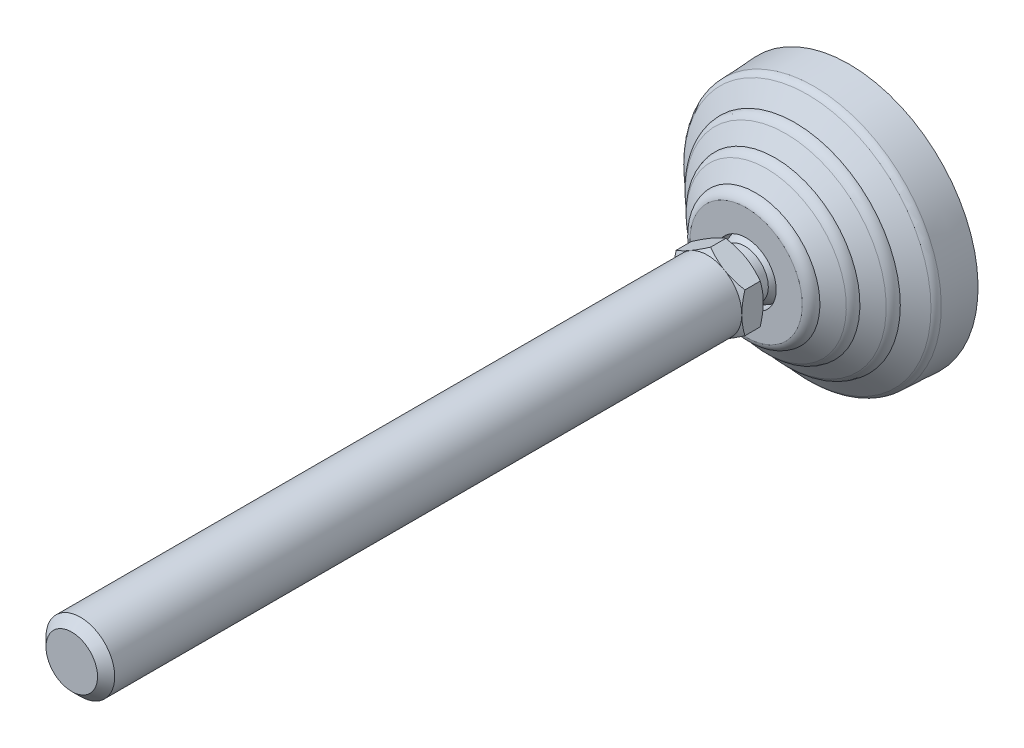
ISO-10303-21;
HEADER;
FILE_DESCRIPTION(('STEP AP214'),'2;1');
FILE_NAME('part.step','',(''),(''),'','','');
FILE_SCHEMA(('AUTOMOTIVE_DESIGN { 1 0 10303 214 1 1 1 1 }'));
ENDSEC;
DATA;
#1=APPLICATION_CONTEXT('core data for automotive mechanical design processes');
#2=APPLICATION_PROTOCOL_DEFINITION('international standard','automotive_design',2000,#1);
#3=PRODUCT_CONTEXT('',#1,'mechanical');
#4=PRODUCT('Part','Part','',(#3));
#5=PRODUCT_RELATED_PRODUCT_CATEGORY('part','',(#4));
#6=PRODUCT_DEFINITION_FORMATION('','',#4);
#7=PRODUCT_DEFINITION_CONTEXT('part definition',#1,'design');
#8=PRODUCT_DEFINITION('design','',#6,#7);
#9=PRODUCT_DEFINITION_SHAPE('','',#8);
#10=(LENGTH_UNIT() NAMED_UNIT(*) SI_UNIT(.MILLI.,.METRE.));
#11=(NAMED_UNIT(*) PLANE_ANGLE_UNIT() SI_UNIT($,.RADIAN.));
#12=(NAMED_UNIT(*) SI_UNIT($,.STERADIAN.) SOLID_ANGLE_UNIT());
#13=UNCERTAINTY_MEASURE_WITH_UNIT(LENGTH_MEASURE(1.E-05),#10,'distance_accuracy_value','');
#14=(GEOMETRIC_REPRESENTATION_CONTEXT(3) GLOBAL_UNCERTAINTY_ASSIGNED_CONTEXT((#13)) GLOBAL_UNIT_ASSIGNED_CONTEXT((#10,
#11,#12)) REPRESENTATION_CONTEXT('',''));
#15=CARTESIAN_POINT('',(0.,0.,0.));
#16=DIRECTION('',(0.,0.,1.));
#17=DIRECTION('',(1.,0.,0.));
#18=AXIS2_PLACEMENT_3D('',#15,#16,#17);
#19=CARTESIAN_POINT('',(0.,0.,85.773));
#20=DIRECTION('',(0.,0.,-1.));
#21=DIRECTION('',(0.,1.,0.));
#22=AXIS2_PLACEMENT_3D('',#19,#20,#21);
#23=CYLINDRICAL_SURFACE('',#22,8.);
#24=CARTESIAN_POINT('',(0.,0.,179.));
#25=DIRECTION('',(0.,0.,1.));
#26=DIRECTION('',(0.,-1.,0.));
#27=AXIS2_PLACEMENT_3D('',#24,#25,#26);
#28=CIRCLE('',#27,8.);
#29=CARTESIAN_POINT('',(0.,-8.,179.));
#30=VERTEX_POINT('',#29);
#31=EDGE_CURVE('E9',#30,#30,#28,.F.);
#32=ORIENTED_EDGE('',*,*,#31,.T.);
#33=EDGE_LOOP('',(#32));
#34=FACE_BOUND('',#33,.T.);
#35=CARTESIAN_POINT('',(0.,0.,33.));
#36=DIRECTION('',(0.,0.,-1.));
#37=DIRECTION('',(0.,1.,0.));
#38=AXIS2_PLACEMENT_3D('',#35,#36,#37);
#39=CIRCLE('',#38,8.);
#40=CARTESIAN_POINT('',(0.,8.,33.));
#41=VERTEX_POINT('',#40);
#42=EDGE_CURVE('E124',#41,#41,#39,.F.);
#43=ORIENTED_EDGE('',*,*,#42,.T.);
#44=EDGE_LOOP('',(#43));
#45=FACE_BOUND('',#44,.T.);
#46=ADVANCED_FACE('F14',(#34,#45),#23,.T.);
#47=CARTESIAN_POINT('',(7.995,0.,33.));
#48=DIRECTION('',(0.,0.,-1.));
#49=DIRECTION('',(0.,1.,0.));
#50=AXIS2_PLACEMENT_3D('',#47,#48,#49);
#51=PLANE('',#50);
#52=CARTESIAN_POINT('',(0.,0.,33.));
#53=DIRECTION('',(0.,0.,-1.));
#54=DIRECTION('',(0.,1.,0.));
#55=AXIS2_PLACEMENT_3D('',#52,#53,#54);
#56=CIRCLE('',#55,7.99);
#57=CARTESIAN_POINT('',(0.,7.99,33.));
#58=VERTEX_POINT('',#57);
#59=EDGE_CURVE('E132',#58,#58,#56,.F.);
#60=ORIENTED_EDGE('',*,*,#59,.T.);
#61=EDGE_LOOP('',(#60));
#62=FACE_BOUND('',#61,.T.);
#63=ORIENTED_EDGE('',*,*,#42,.F.);
#64=EDGE_LOOP('',(#63));
#65=FACE_BOUND('',#64,.T.);
#66=ADVANCED_FACE('F157',(#62,#65),#51,.T.);
#67=CARTESIAN_POINT('',(0.,0.,32.2753734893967));
#68=DIRECTION('',(0.,0.,-1.));
#69=DIRECTION('',(0.,1.,0.));
#70=AXIS2_PLACEMENT_3D('',#67,#68,#69);
#71=CONICAL_SURFACE('',#70,9.2450899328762,1.0471975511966);
#72=ORIENTED_EDGE('',*,*,#59,.F.);
#73=EDGE_LOOP('',(#72));
#74=FACE_BOUND('',#73,.T.);
#75=CARTESIAN_POINT('',(-4.19327851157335E-08,-9.23760428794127,32.2796952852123));
#76=CARTESIAN_POINT('',(0.175847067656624,-9.13607893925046,32.3382996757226));
#77=CARTESIAN_POINT('',(0.352349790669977,-9.03417505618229,32.3942441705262));
#78=CARTESIAN_POINT('',(0.706788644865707,-8.82953969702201,32.5000807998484));
#79=CARTESIAN_POINT('',(0.884725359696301,-8.72680788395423,32.5499703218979));
#80=CARTESIAN_POINT('',(1.42138431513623,-8.41696768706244,32.6895770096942));
#81=CARTESIAN_POINT('',(1.78222493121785,-8.20863626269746,32.7689823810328));
#82=CARTESIAN_POINT('',(2.32221590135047,-7.896872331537,32.862092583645));
#83=CARTESIAN_POINT('',(2.49975318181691,-7.79437113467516,32.8886165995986));
#84=CARTESIAN_POINT('',(2.85563052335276,-7.58890525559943,32.9330919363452));
#85=CARTESIAN_POINT('',(3.03397051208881,-7.48594061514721,32.9510440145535));
#86=CARTESIAN_POINT('',(3.3909574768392,-7.27983409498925,32.9779205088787));
#87=CARTESIAN_POINT('',(3.56960387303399,-7.17669255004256,32.9868551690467));
#88=CARTESIAN_POINT('',(3.92706158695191,-6.97031424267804,32.9955052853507));
#89=CARTESIAN_POINT('',(4.10587289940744,-6.86707748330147,32.995221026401));
#90=CARTESIAN_POINT('',(4.44015430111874,-6.67408002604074,32.9860752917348));
#91=CARTESIAN_POINT('',(4.59564800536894,-6.58430569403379,32.9783294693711));
#92=CARTESIAN_POINT('',(4.90627121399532,-6.4049673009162,32.956016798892));
#93=CARTESIAN_POINT('',(5.06140069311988,-6.31540325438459,32.9414494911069));
#94=CARTESIAN_POINT('',(5.52618852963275,-6.04705787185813,32.8878596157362));
#95=CARTESIAN_POINT('',(5.83502420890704,-5.86875150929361,32.8389557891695));
#96=CARTESIAN_POINT('',(6.45597113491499,-5.51024763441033,32.7166979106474));
#97=CARTESIAN_POINT('',(6.76800315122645,-5.33009586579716,32.6428257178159));
#98=CARTESIAN_POINT('',(7.38741452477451,-4.97247854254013,32.4751673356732));
#99=CARTESIAN_POINT('',(7.69480181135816,-4.79500840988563,32.3814205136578));
#100=CARTESIAN_POINT('',(7.9999999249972,-4.6188021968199,32.2796953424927));
#101=B_SPLINE_CURVE_WITH_KNOTS('',3,(#75,#76,#77,#78,#79,#80,#81,#82,#83,#84,#85,#86,#87,#88,
#89,#90,#91,#92,#93,#94,#95,#96,#97,#98,#99,#100),.UNSPECIFIED.,.F.,.F.,(4,2,2,2,2,2,2,2,2,2,2,
2,4),(0.,0.633965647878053,1.26820386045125,2.53931509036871,3.15930425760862,3.77923863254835,
4.39846794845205,5.01767812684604,5.55669080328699,6.09573980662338,7.17460542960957,
8.2773951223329,9.37802050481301),.UNSPECIFIED.);
#102=CARTESIAN_POINT('',(-1.44240227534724E-08,-9.23760431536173,32.2796953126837));
#103=VERTEX_POINT('',#102);
#104=CARTESIAN_POINT('',(8.,-4.61880217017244,32.2796953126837));
#105=VERTEX_POINT('',#104);
#106=EDGE_CURVE('E143',#103,#105,#101,.T.);
#107=ORIENTED_EDGE('',*,*,#106,.T.);
#108=CARTESIAN_POINT('',(7.9999999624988,-4.6188021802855,32.2796952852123));
#109=CARTESIAN_POINT('',(7.99999998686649,-4.23969380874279,32.3891659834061));
#110=CARTESIAN_POINT('',(7.999999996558,-3.85751175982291,32.4893813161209));
#111=CARTESIAN_POINT('',(8.00000000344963,-3.08693961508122,32.6664987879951));
#112=CARTESIAN_POINT('',(8.00000000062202,-2.69853763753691,32.7433487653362));
#113=CARTESIAN_POINT('',(7.99999999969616,-2.11699996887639,32.8364192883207));
#114=CARTESIAN_POINT('',(7.99999999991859,-1.92560834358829,32.8635449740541));
#115=CARTESIAN_POINT('',(8.0000000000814,-1.54193621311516,32.9104602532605));
#116=CARTESIAN_POINT('',(8.0000000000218,-1.34965578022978,32.9302504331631));
#117=CARTESIAN_POINT('',(7.99999999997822,-0.96464588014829,32.962068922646));
#118=CARTESIAN_POINT('',(7.99999999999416,-0.771917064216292,32.9741050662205));
#119=CARTESIAN_POINT('',(8.00000000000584,-0.386125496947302,32.9901838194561));
#120=CARTESIAN_POINT('',(8.00000000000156,-0.193062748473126,32.9942264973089));
#121=CARTESIAN_POINT('',(7.99999999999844,0.193062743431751,32.9942264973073));
#122=CARTESIAN_POINT('',(7.99999999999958,0.386125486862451,32.990183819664));
#123=CARTESIAN_POINT('',(8.00000000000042,0.771917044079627,32.9741050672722));
#124=CARTESIAN_POINT('',(8.00000000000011,0.96464585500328,32.962068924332));
#125=CARTESIAN_POINT('',(7.99999999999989,1.34965574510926,32.930250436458));
#126=CARTESIAN_POINT('',(7.99999999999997,1.54193617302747,32.9104602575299));
#127=CARTESIAN_POINT('',(8.00000000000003,1.92560829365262,32.8635449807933));
#128=CARTESIAN_POINT('',(8.00000000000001,2.11699991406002,32.8364192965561));
#129=CARTESIAN_POINT('',(7.99999999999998,2.69853756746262,32.7433487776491));
#130=CARTESIAN_POINT('',(7.99999999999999,3.0869395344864,32.6664988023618));
#131=CARTESIAN_POINT('',(8.00000000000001,3.85751166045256,32.4893813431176));
#132=CARTESIAN_POINT('',(8.00000000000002,4.23969370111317,32.3891660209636));
#133=CARTESIAN_POINT('',(8.,4.61880206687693,32.2796953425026));
#134=B_SPLINE_CURVE_WITH_KNOTS('',3,(#108,#109,#110,#111,#112,#113,#114,#115,#116,#117,#118,
#119,#120,#121,#122,#123,#124,#125,#126,#127,#128,#129,#130,#131,#132,#133),.UNSPECIFIED.,.F.,
.F.,(4,2,2,2,2,2,2,2,2,2,2,2,4),(0.,1.1842935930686,2.37121196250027,2.95099639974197,
3.53073447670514,4.10988591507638,4.68903241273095,5.26817889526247,5.84733031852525,
6.42706838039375,7.00685280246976,8.19377114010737,9.37806470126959),.UNSPECIFIED.);
#135=CARTESIAN_POINT('',(8.00000001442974,4.618802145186,32.2796953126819));
#136=VERTEX_POINT('',#135);
#137=EDGE_CURVE('E135',#105,#136,#134,.T.);
#138=ORIENTED_EDGE('',*,*,#137,.T.);
#139=CARTESIAN_POINT('',(8.00000000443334,4.61880210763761,32.2796952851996));
#140=CARTESIAN_POINT('',(7.82415291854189,4.72032749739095,32.3382996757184));
#141=CARTESIAN_POINT('',(7.64765020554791,4.8222313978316,32.3942441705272));
#142=CARTESIAN_POINT('',(7.29321135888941,5.02686677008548,32.500080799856));
#143=CARTESIAN_POINT('',(7.11527464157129,5.12959857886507,32.549970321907));
#144=CARTESIAN_POINT('',(6.57861568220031,5.43943876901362,32.689577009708));
#145=CARTESIAN_POINT('',(6.21777506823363,5.6477701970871,32.7689823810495));
#146=CARTESIAN_POINT('',(5.67778409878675,5.95953412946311,32.8620925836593));
#147=CARTESIAN_POINT('',(5.50024681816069,6.06203532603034,32.8886165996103));
#148=CARTESIAN_POINT('',(5.14436947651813,6.2675012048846,32.9330919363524));
#149=CARTESIAN_POINT('',(4.96602948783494,6.37046584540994,32.9510440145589));
#150=CARTESIAN_POINT('',(4.60904252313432,6.57657236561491,32.977920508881));
#151=CARTESIAN_POINT('',(4.43039612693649,6.6797139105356,32.986855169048));
#152=CARTESIAN_POINT('',(4.0729384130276,6.88609221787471,32.9955052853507));
#153=CARTESIAN_POINT('',(3.89412710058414,6.98932897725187,32.9952210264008));
#154=CARTESIAN_POINT('',(3.55984569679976,7.18232643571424,32.9860752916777));
#155=CARTESIAN_POINT('',(3.40435199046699,7.27210076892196,32.9783294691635));
#156=CARTESIAN_POINT('',(3.09372877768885,7.45143916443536,32.9560167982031));
#157=CARTESIAN_POINT('',(2.93859929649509,7.54100321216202,32.9414494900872));
#158=CARTESIAN_POINT('',(2.47381145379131,7.80934859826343,32.8878596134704));
#159=CARTESIAN_POINT('',(2.16497577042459,7.98765496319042,32.8389557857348));
#160=CARTESIAN_POINT('',(1.54402883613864,8.34615884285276,32.7166979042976));
#161=CARTESIAN_POINT('',(1.23199681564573,8.52631061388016,32.6428257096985));
#162=CARTESIAN_POINT('',(0.612585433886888,8.8839279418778,32.4751673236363));
#163=CARTESIAN_POINT('',(0.305198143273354,9.06139807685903,32.3814204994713));
#164=CARTESIAN_POINT('',(2.56600579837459E-08,9.23760429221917,32.2796953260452));
#165=B_SPLINE_CURVE_WITH_KNOTS('',3,(#139,#140,#141,#142,#143,#144,#145,#146,#147,#148,#149,
#150,#151,#152,#153,#154,#155,#156,#157,#158,#159,#160,#161,#162,#163,#164),.UNSPECIFIED.,.F.,
.F.,(4,2,2,2,2,2,2,2,2,2,2,2,4),(0.,0.633965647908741,1.26820386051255,2.53931509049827,
3.15930425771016,3.77923863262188,4.39846794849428,5.01767812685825,5.55669081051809,
6.09573982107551,7.1746054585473,8.27739516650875,9.37802056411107),.UNSPECIFIED.);
#166=CARTESIAN_POINT('',(-1.15386855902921E-08,9.23760430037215,32.279695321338));
#167=VERTEX_POINT('',#166);
#168=EDGE_CURVE('E180',#136,#167,#165,.T.);
#169=ORIENTED_EDGE('',*,*,#168,.T.);
#170=CARTESIAN_POINT('',(-1.65350876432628E-08,9.23760427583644,32.2796953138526));
#171=CARTESIAN_POINT('',(-0.175847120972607,9.13607891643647,32.3382996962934));
#172=CARTESIAN_POINT('',(-0.352349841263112,9.03417502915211,32.3942441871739));
#173=CARTESIAN_POINT('',(-0.706788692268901,8.82953966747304,32.5000808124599));
#174=CARTESIAN_POINT('',(-0.884725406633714,8.72680785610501,32.5499703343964));
#175=CARTESIAN_POINT('',(-1.42138436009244,8.41696766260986,32.6895770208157));
#176=CARTESIAN_POINT('',(-1.78222497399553,8.20863623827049,32.7689823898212));
#177=CARTESIAN_POINT('',(-2.32221594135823,7.89687230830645,32.8620925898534));
#178=CARTESIAN_POINT('',(-2.4997532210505,7.79437111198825,32.8886166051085));
#179=CARTESIAN_POINT('',(-2.85563056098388,7.58890523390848,32.9330919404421));
#180=CARTESIAN_POINT('',(-3.03397054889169,7.48594059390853,32.9510440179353));
#181=CARTESIAN_POINT('',(-3.39095751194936,7.27983407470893,32.9779205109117));
#182=CARTESIAN_POINT('',(-3.56960390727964,7.1766925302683,32.9868551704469));
#183=CARTESIAN_POINT('',(-3.92706161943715,6.97031422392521,32.9955052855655));
#184=CARTESIAN_POINT('',(-4.10587293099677,6.867077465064,32.9952210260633));
#185=CARTESIAN_POINT('',(-4.44015433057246,6.67408000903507,32.9860752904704));
#186=CARTESIAN_POINT('',(-4.59564803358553,6.58430567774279,32.9783294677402));
#187=CARTESIAN_POINT('',(-4.90627123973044,6.40496728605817,32.9560167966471));
#188=CARTESIAN_POINT('',(-5.06140071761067,6.31540324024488,32.9414494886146));
#189=CARTESIAN_POINT('',(-5.52618855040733,6.04705785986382,32.8878596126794));
#190=CARTESIAN_POINT('',(-5.83502422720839,5.8687514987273,32.8389557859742));
#191=CARTESIAN_POINT('',(-6.45597114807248,5.51024762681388,32.7166979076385));
#192=CARTESIAN_POINT('',(-6.76800316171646,5.33009585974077,32.6428257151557));
#193=CARTESIAN_POINT('',(-7.38741452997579,4.97247853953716,32.4751673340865));
#194=CARTESIAN_POINT('',(-7.69480181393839,4.7950084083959,32.381420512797));
#195=CARTESIAN_POINT('',(-7.9999999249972,4.6188021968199,32.2796953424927));
#196=B_SPLINE_CURVE_WITH_KNOTS('',3,(#170,#171,#172,#173,#174,#175,#176,#177,#178,#179,#180,
#181,#182,#183,#184,#185,#186,#187,#188,#189,#190,#191,#192,#193,#194,#195),.UNSPECIFIED.,.F.,
.F.,(4,2,2,2,2,2,2,2,2,2,2,2,4),(0.,0.633965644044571,1.26820385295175,2.5393150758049,
3.15930423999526,3.77923861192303,4.39846792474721,5.01767810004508,5.55669077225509,
6.09573977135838,7.17460538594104,8.27739506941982,9.37802044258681),.UNSPECIFIED.);
#197=CARTESIAN_POINT('',(-8.,4.61880217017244,32.2796953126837));
#198=VERTEX_POINT('',#197);
#199=EDGE_CURVE('E172',#167,#198,#196,.T.);
#200=ORIENTED_EDGE('',*,*,#199,.T.);
#201=CARTESIAN_POINT('',(-7.9999999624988,4.6188021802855,32.2796952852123));
#202=CARTESIAN_POINT('',(-7.99999998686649,4.23969380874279,32.3891659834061));
#203=CARTESIAN_POINT('',(-7.999999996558,3.85751175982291,32.4893813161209));
#204=CARTESIAN_POINT('',(-8.00000000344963,3.08693961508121,32.6664987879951));
#205=CARTESIAN_POINT('',(-8.00000000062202,2.69853763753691,32.7433487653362));
#206=CARTESIAN_POINT('',(-7.99999999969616,2.11699996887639,32.8364192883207));
#207=CARTESIAN_POINT('',(-7.99999999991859,1.92560834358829,32.8635449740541));
#208=CARTESIAN_POINT('',(-8.0000000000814,1.54193621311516,32.9104602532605));
#209=CARTESIAN_POINT('',(-8.0000000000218,1.34965578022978,32.9302504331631));
#210=CARTESIAN_POINT('',(-7.99999999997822,0.964645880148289,32.962068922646));
#211=CARTESIAN_POINT('',(-7.99999999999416,0.77191706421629,32.9741050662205));
#212=CARTESIAN_POINT('',(-8.00000000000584,0.386125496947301,32.9901838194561));
#213=CARTESIAN_POINT('',(-8.00000000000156,0.193062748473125,32.9942264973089));
#214=CARTESIAN_POINT('',(-7.99999999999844,-0.193062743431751,32.9942264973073));
#215=CARTESIAN_POINT('',(-7.99999999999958,-0.386125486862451,32.990183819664));
#216=CARTESIAN_POINT('',(-8.00000000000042,-0.771917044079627,32.9741050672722));
#217=CARTESIAN_POINT('',(-8.00000000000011,-0.96464585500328,32.962068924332));
#218=CARTESIAN_POINT('',(-7.99999999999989,-1.34965574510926,32.930250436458));
#219=CARTESIAN_POINT('',(-7.99999999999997,-1.54193617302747,32.9104602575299));
#220=CARTESIAN_POINT('',(-8.00000000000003,-1.92560829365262,32.8635449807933));
#221=CARTESIAN_POINT('',(-8.00000000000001,-2.11699991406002,32.8364192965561));
#222=CARTESIAN_POINT('',(-7.99999999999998,-2.69853756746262,32.7433487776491));
#223=CARTESIAN_POINT('',(-7.99999999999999,-3.0869395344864,32.6664988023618));
#224=CARTESIAN_POINT('',(-8.00000000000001,-3.85751166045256,32.4893813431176));
#225=CARTESIAN_POINT('',(-8.00000000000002,-4.23969370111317,32.3891660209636));
#226=CARTESIAN_POINT('',(-8.,-4.61880206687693,32.2796953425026));
#227=B_SPLINE_CURVE_WITH_KNOTS('',3,(#201,#202,#203,#204,#205,#206,#207,#208,#209,#210,#211,
#212,#213,#214,#215,#216,#217,#218,#219,#220,#221,#222,#223,#224,#225,#226),.UNSPECIFIED.,.F.,
.F.,(4,2,2,2,2,2,2,2,2,2,2,2,4),(0.,1.18429359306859,2.37121196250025,2.95099639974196,
3.53073447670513,4.10988591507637,4.68903241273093,5.26817889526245,5.84733031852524,
6.42706838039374,7.00685280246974,8.19377114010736,9.37806470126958),.UNSPECIFIED.);
#228=CARTESIAN_POINT('',(-8.00000001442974,-4.61880214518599,32.2796953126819));
#229=VERTEX_POINT('',#228);
#230=EDGE_CURVE('E342',#198,#229,#227,.T.);
#231=ORIENTED_EDGE('',*,*,#230,.T.);
#232=CARTESIAN_POINT('',(-8.00000000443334,-4.61880210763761,32.2796952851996));
#233=CARTESIAN_POINT('',(-7.82415291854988,-4.72032749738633,32.3382996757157));
#234=CARTESIAN_POINT('',(-7.64765020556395,-4.82223139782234,32.3942441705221));
#235=CARTESIAN_POINT('',(-7.29321135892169,-5.02686677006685,32.5000807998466));
#236=CARTESIAN_POINT('',(-7.11527464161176,-5.1295985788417,32.5499703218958));
#237=CARTESIAN_POINT('',(-6.57861568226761,-5.43943876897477,32.6895770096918));
#238=CARTESIAN_POINT('',(-6.21777506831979,-5.64777019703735,32.7689823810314));
#239=CARTESIAN_POINT('',(-5.67778409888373,-5.95953412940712,32.8620925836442));
#240=CARTESIAN_POINT('',(-5.50024681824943,-6.06203532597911,32.8886165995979));
#241=CARTESIAN_POINT('',(-5.14436947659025,-6.26750120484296,32.9330919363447));
#242=CARTESIAN_POINT('',(-4.96602948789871,-6.37046584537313,32.9510440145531));
#243=CARTESIAN_POINT('',(-4.60904252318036,-6.57657236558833,32.9779205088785));
#244=CARTESIAN_POINT('',(-4.43039612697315,-6.67971391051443,32.9868551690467));
#245=CARTESIAN_POINT('',(-4.0729384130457,-6.88609221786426,32.9955052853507));
#246=CARTESIAN_POINT('',(-3.89412710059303,-6.98932897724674,32.995221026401));
#247=CARTESIAN_POINT('',(-3.55984569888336,-7.18232643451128,32.9860752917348));
#248=CARTESIAN_POINT('',(-3.40435199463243,-7.27210076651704,32.9783294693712));
#249=CARTESIAN_POINT('',(-3.09372878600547,-7.45143915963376,32.9560167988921));
#250=CARTESIAN_POINT('',(-2.93859930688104,-7.54100320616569,32.941449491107));
#251=CARTESIAN_POINT('',(-2.47381147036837,-7.80934858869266,32.8878596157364));
#252=CARTESIAN_POINT('',(-2.16497579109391,-7.98765495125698,32.8389557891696));
#253=CARTESIAN_POINT('',(-1.54402886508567,-8.34615882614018,32.7166979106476));
#254=CARTESIAN_POINT('',(-1.2319968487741,-8.52631059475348,32.642825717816));
#255=CARTESIAN_POINT('',(-0.612585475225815,-8.88392791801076,32.4751673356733));
#256=CARTESIAN_POINT('',(-0.305198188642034,-9.06139805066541,32.3814205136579));
#257=CARTESIAN_POINT('',(-7.50027841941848E-08,-9.23760426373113,32.2796953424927));
#258=B_SPLINE_CURVE_WITH_KNOTS('',3,(#232,#233,#234,#235,#236,#237,#238,#239,#240,#241,#242,
#243,#244,#245,#246,#247,#248,#249,#250,#251,#252,#253,#254,#255,#256,#257),.UNSPECIFIED.,.F.,
.F.,(4,2,2,2,2,2,2,2,2,2,2,2,4),(0.,0.633965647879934,1.26820386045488,2.53931509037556,
3.15930425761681,3.77923863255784,4.39846794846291,5.01767812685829,5.55669080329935,
6.09573980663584,7.17460542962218,8.27739512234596,9.37802050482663),.UNSPECIFIED.);
#259=EDGE_CURVE('E162',#229,#103,#258,.T.);
#260=ORIENTED_EDGE('',*,*,#259,.T.);
#261=EDGE_LOOP('',(#107,#138,#169,#200,#231,#260));
#262=FACE_BOUND('',#261,.T.);
#263=ADVANCED_FACE('F152',(#74,#262),#71,.T.);
#264=CARTESIAN_POINT('',(0.,-9.23760430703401,33.1));
#265=DIRECTION('',(0.5,0.866025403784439,0.));
#266=DIRECTION('',(-0.866025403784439,0.5,0.));
#267=AXIS2_PLACEMENT_3D('',#264,#265,#266);
#268=PLANE('',#267);
#269=DIRECTION('',(0.,0.,1.));
#270=VECTOR('',#269,1.);
#271=CARTESIAN_POINT('',(0.,-9.23760430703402,33.1));
#272=LINE('',#271,#270);
#273=CARTESIAN_POINT('',(0.,-9.23760430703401,28.7203046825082));
#274=VERTEX_POINT('',#273);
#275=EDGE_CURVE('E368',#274,#103,#272,.T.);
#276=ORIENTED_EDGE('',*,*,#275,.T.);
#277=ORIENTED_EDGE('',*,*,#259,.F.);
#278=DIRECTION('',(0.,0.,1.));
#279=VECTOR('',#278,1.);
#280=CARTESIAN_POINT('',(-8.,-4.61880215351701,33.1));
#281=LINE('',#280,#279);
#282=CARTESIAN_POINT('',(-8.,-4.61880215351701,28.7203046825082));
#283=VERTEX_POINT('',#282);
#284=EDGE_CURVE('E360',#283,#229,#281,.T.);
#285=ORIENTED_EDGE('',*,*,#284,.F.);
#286=CARTESIAN_POINT('',(0.,-9.23760430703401,28.7203046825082));
#287=CARTESIAN_POINT('',(-0.175847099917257,-9.13607893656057,28.6617003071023));
#288=CARTESIAN_POINT('',(-0.35234981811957,-9.03417504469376,28.6057558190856));
#289=CARTESIAN_POINT('',(-0.706788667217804,-8.82953967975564,28.4999191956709));
#290=CARTESIAN_POINT('',(-0.884725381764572,-8.72680786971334,28.4500296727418));
#291=CARTESIAN_POINT('',(-1.42138433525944,-8.41696767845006,28.3104229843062));
#292=CARTESIAN_POINT('',(-1.78222494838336,-8.20863625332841,28.2310176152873));
#293=CARTESIAN_POINT('',(-2.32221591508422,-7.89687232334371,28.1379074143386));
#294=CARTESIAN_POINT('',(-2.49975319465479,-7.79437112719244,28.1113833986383));
#295=CARTESIAN_POINT('',(-2.8556305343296,-7.5889052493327,28.0669080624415));
#296=CARTESIAN_POINT('',(-3.03397052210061,-7.48594060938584,28.0489559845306));
#297=CARTESIAN_POINT('',(-3.3909574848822,-7.2798340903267,28.0220794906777));
#298=CARTESIAN_POINT('',(-3.56960388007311,-7.17669254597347,28.0131448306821));
#299=CARTESIAN_POINT('',(-3.9270615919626,-6.97031423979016,28.0044947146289));
#300=CARTESIAN_POINT('',(-4.10587290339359,-6.86707748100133,28.0047789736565));
#301=CARTESIAN_POINT('',(-4.44015430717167,-6.67408002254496,28.0139247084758));
#302=CARTESIAN_POINT('',(-4.59564801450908,-6.58430568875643,28.0216705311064));
#303=CARTESIAN_POINT('',(-4.90627122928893,-6.40496729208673,28.0439832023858));
#304=CARTESIAN_POINT('',(-5.06140071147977,-6.3154032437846,28.0585505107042));
#305=CARTESIAN_POINT('',(-5.52618855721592,-6.04705785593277,28.1121403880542));
#306=CARTESIAN_POINT('',(-5.83502424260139,-5.86875148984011,28.161044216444));
#307=CARTESIAN_POINT('',(-6.45597118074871,-5.51024760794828,28.2833020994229));
#308=CARTESIAN_POINT('',(-6.76800320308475,-5.33009583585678,28.3571742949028));
#309=CARTESIAN_POINT('',(-7.38741458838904,-4.97247850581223,28.5248326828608));
#310=CARTESIAN_POINT('',(-7.69480188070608,-4.79500836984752,28.6185795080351));
#311=CARTESIAN_POINT('',(-8.,-4.61880215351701,28.7203046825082));
#312=B_SPLINE_CURVE_WITH_KNOTS('',3,(#286,#287,#288,#289,#290,#291,#292,#293,#294,#295,#296,
#297,#298,#299,#300,#301,#302,#303,#304,#305,#306,#307,#308,#309,#310,#311),.UNSPECIFIED.,.F.,
.F.,(4,2,2,2,2,2,2,2,2,2,2,2,4),(0.,0.633965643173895,1.26820385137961,2.53931507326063,
3.15930423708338,3.77923860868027,4.3984679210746,5.01767809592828,5.55669078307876,
6.0957397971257,7.17460544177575,8.27739515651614,9.37802056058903),.UNSPECIFIED.);
#313=EDGE_CURVE('E362',#274,#283,#312,.T.);
#314=ORIENTED_EDGE('',*,*,#313,.F.);
#315=EDGE_LOOP('',(#276,#277,#285,#314));
#316=FACE_BOUND('',#315,.T.);
#317=ADVANCED_FACE('F156',(#316),#268,.F.);
#318=CARTESIAN_POINT('',(8.,-4.61880215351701,33.1));
#319=DIRECTION('',(-0.5,0.866025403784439,0.));
#320=DIRECTION('',(-0.866025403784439,-0.5,0.));
#321=AXIS2_PLACEMENT_3D('',#318,#319,#320);
#322=PLANE('',#321);
#323=DIRECTION('',(0.,0.,1.));
#324=VECTOR('',#323,1.);
#325=CARTESIAN_POINT('',(8.,-4.61880215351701,33.1));
#326=LINE('',#325,#324);
#327=CARTESIAN_POINT('',(8.,-4.61880215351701,28.7203046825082));
#328=VERTEX_POINT('',#327);
#329=EDGE_CURVE('E31',#328,#105,#326,.T.);
#330=ORIENTED_EDGE('',*,*,#329,.T.);
#331=ORIENTED_EDGE('',*,*,#106,.F.);
#332=ORIENTED_EDGE('',*,*,#275,.F.);
#333=CARTESIAN_POINT('',(8.,-4.61880215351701,28.7203046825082));
#334=CARTESIAN_POINT('',(7.82415290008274,-4.72032752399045,28.6617003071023));
#335=CARTESIAN_POINT('',(7.64765018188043,-4.82223141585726,28.6057558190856));
#336=CARTESIAN_POINT('',(7.2932113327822,-5.02686678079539,28.4999191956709));
#337=CARTESIAN_POINT('',(7.11527461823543,-5.12959859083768,28.4500296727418));
#338=CARTESIAN_POINT('',(6.57861566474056,-5.43943878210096,28.3104229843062));
#339=CARTESIAN_POINT('',(6.21777505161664,-5.64777020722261,28.2310176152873));
#340=CARTESIAN_POINT('',(5.67778408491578,-5.95953413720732,28.1379074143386));
#341=CARTESIAN_POINT('',(5.50024680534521,-6.06203533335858,28.1113833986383));
#342=CARTESIAN_POINT('',(5.14436946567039,-6.26750121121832,28.0669080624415));
#343=CARTESIAN_POINT('',(4.96602947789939,-6.37046585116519,28.0489559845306));
#344=CARTESIAN_POINT('',(4.60904251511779,-6.57657237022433,28.0220794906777));
#345=CARTESIAN_POINT('',(4.43039611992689,-6.67971391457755,28.0131448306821));
#346=CARTESIAN_POINT('',(4.0729384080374,-6.88609222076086,28.0044947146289));
#347=CARTESIAN_POINT('',(3.89412709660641,-6.98932897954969,28.0047789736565));
#348=CARTESIAN_POINT('',(3.55984569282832,-7.18232643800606,28.0139247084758));
#349=CARTESIAN_POINT('',(3.40435198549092,-7.2721007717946,28.0216705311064));
#350=CARTESIAN_POINT('',(3.09372877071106,-7.45143916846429,28.0439832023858));
#351=CARTESIAN_POINT('',(2.93859928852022,-7.54100321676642,28.0585505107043));
#352=CARTESIAN_POINT('',(2.47381144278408,-7.80934860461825,28.1121403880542));
#353=CARTESIAN_POINT('',(2.16497575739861,-7.98765497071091,28.161044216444));
#354=CARTESIAN_POINT('',(1.54402881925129,-8.34615885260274,28.2833020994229));
#355=CARTESIAN_POINT('',(1.23199679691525,-8.52631062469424,28.3571742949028));
#356=CARTESIAN_POINT('',(0.612585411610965,-8.88392795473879,28.5248326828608));
#357=CARTESIAN_POINT('',(0.305198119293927,-9.0613980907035,28.6185795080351));
#358=CARTESIAN_POINT('',(0.,-9.23760430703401,28.7203046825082));
#359=B_SPLINE_CURVE_WITH_KNOTS('',3,(#333,#334,#335,#336,#337,#338,#339,#340,#341,#342,#343,
#344,#345,#346,#347,#348,#349,#350,#351,#352,#353,#354,#355,#356,#357,#358),.UNSPECIFIED.,.F.,
.F.,(4,2,2,2,2,2,2,2,2,2,2,2,4),(0.,0.633965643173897,1.26820385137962,2.53931507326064,
3.15930423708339,3.77923860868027,4.39846792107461,5.01767809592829,5.55669078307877,
6.09573979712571,7.17460544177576,8.27739515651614,9.37802056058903),.UNSPECIFIED.);
#360=EDGE_CURVE('E369',#328,#274,#359,.T.);
#361=ORIENTED_EDGE('',*,*,#360,.F.);
#362=EDGE_LOOP('',(#330,#331,#332,#361));
#363=FACE_BOUND('',#362,.T.);
#364=ADVANCED_FACE('F375',(#363),#322,.F.);
#365=CARTESIAN_POINT('',(-8.,4.61880215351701,33.1));
#366=DIRECTION('',(0.5,-0.866025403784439,0.));
#367=DIRECTION('',(0.866025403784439,0.5,0.));
#368=AXIS2_PLACEMENT_3D('',#365,#366,#367);
#369=PLANE('',#368);
#370=DIRECTION('',(0.,0.,1.));
#371=VECTOR('',#370,1.);
#372=CARTESIAN_POINT('',(-8.,4.61880215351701,33.1));
#373=LINE('',#372,#371);
#374=CARTESIAN_POINT('',(-8.,4.61880215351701,28.7203046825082));
#375=VERTEX_POINT('',#374);
#376=EDGE_CURVE('E361',#375,#198,#373,.T.);
#377=ORIENTED_EDGE('',*,*,#376,.T.);
#378=ORIENTED_EDGE('',*,*,#199,.F.);
#379=DIRECTION('',(0.,0.,1.));
#380=VECTOR('',#379,1.);
#381=CARTESIAN_POINT('',(0.,9.23760430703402,33.1));
#382=LINE('',#381,#380);
#383=CARTESIAN_POINT('',(0.,9.23760430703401,28.7203046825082));
#384=VERTEX_POINT('',#383);
#385=EDGE_CURVE('E211',#384,#167,#382,.T.);
#386=ORIENTED_EDGE('',*,*,#385,.F.);
#387=CARTESIAN_POINT('',(-8.,4.61880215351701,28.7203046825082));
#388=CARTESIAN_POINT('',(-7.82415290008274,4.72032752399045,28.6617003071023));
#389=CARTESIAN_POINT('',(-7.64765018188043,4.82223141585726,28.6057558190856));
#390=CARTESIAN_POINT('',(-7.2932113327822,5.02686678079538,28.4999191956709));
#391=CARTESIAN_POINT('',(-7.11527461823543,5.12959859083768,28.4500296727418));
#392=CARTESIAN_POINT('',(-6.57861566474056,5.43943878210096,28.3104229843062));
#393=CARTESIAN_POINT('',(-6.21777505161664,5.64777020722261,28.2310176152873));
#394=CARTESIAN_POINT('',(-5.67778408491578,5.95953413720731,28.1379074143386));
#395=CARTESIAN_POINT('',(-5.50024680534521,6.06203533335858,28.1113833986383));
#396=CARTESIAN_POINT('',(-5.1443694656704,6.26750121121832,28.0669080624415));
#397=CARTESIAN_POINT('',(-4.96602947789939,6.37046585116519,28.0489559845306));
#398=CARTESIAN_POINT('',(-4.60904251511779,6.57657237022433,28.0220794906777));
#399=CARTESIAN_POINT('',(-4.43039611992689,6.67971391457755,28.0131448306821));
#400=CARTESIAN_POINT('',(-4.0729384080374,6.88609222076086,28.0044947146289));
#401=CARTESIAN_POINT('',(-3.89412709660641,6.98932897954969,28.0047789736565));
#402=CARTESIAN_POINT('',(-3.55984569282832,7.18232643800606,28.0139247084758));
#403=CARTESIAN_POINT('',(-3.40435198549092,7.2721007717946,28.0216705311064));
#404=CARTESIAN_POINT('',(-3.09372877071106,7.45143916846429,28.0439832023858));
#405=CARTESIAN_POINT('',(-2.93859928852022,7.54100321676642,28.0585505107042));
#406=CARTESIAN_POINT('',(-2.47381144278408,7.80934860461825,28.1121403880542));
#407=CARTESIAN_POINT('',(-2.16497575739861,7.98765497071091,28.161044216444));
#408=CARTESIAN_POINT('',(-1.54402881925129,8.34615885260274,28.2833020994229));
#409=CARTESIAN_POINT('',(-1.23199679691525,8.52631062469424,28.3571742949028));
#410=CARTESIAN_POINT('',(-0.612585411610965,8.88392795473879,28.5248326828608));
#411=CARTESIAN_POINT('',(-0.305198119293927,9.0613980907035,28.6185795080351));
#412=CARTESIAN_POINT('',(0.,9.23760430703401,28.7203046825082));
#413=B_SPLINE_CURVE_WITH_KNOTS('',3,(#387,#388,#389,#390,#391,#392,#393,#394,#395,#396,#397,
#398,#399,#400,#401,#402,#403,#404,#405,#406,#407,#408,#409,#410,#411,#412),.UNSPECIFIED.,.F.,
.F.,(4,2,2,2,2,2,2,2,2,2,2,2,4),(0.,0.633965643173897,1.26820385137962,2.53931507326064,
3.15930423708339,3.77923860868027,4.39846792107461,5.01767809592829,5.55669078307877,
6.09573979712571,7.17460544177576,8.27739515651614,9.37802056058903),.UNSPECIFIED.);
#414=EDGE_CURVE('E213',#375,#384,#413,.T.);
#415=ORIENTED_EDGE('',*,*,#414,.F.);
#416=EDGE_LOOP('',(#377,#378,#386,#415));
#417=FACE_BOUND('',#416,.T.);
#418=ADVANCED_FACE('F199',(#417),#369,.F.);
#419=CARTESIAN_POINT('',(-8.,-4.61880215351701,33.1));
#420=DIRECTION('',(1.,0.,0.));
#421=DIRECTION('',(0.,1.,0.));
#422=AXIS2_PLACEMENT_3D('',#419,#420,#421);
#423=PLANE('',#422);
#424=ORIENTED_EDGE('',*,*,#284,.T.);
#425=ORIENTED_EDGE('',*,*,#230,.F.);
#426=ORIENTED_EDGE('',*,*,#376,.F.);
#427=CARTESIAN_POINT('',(-8.,-4.618802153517,28.7203046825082));
#428=CARTESIAN_POINT('',(-8.,-4.23969378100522,28.6108340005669));
#429=CARTESIAN_POINT('',(-8.,-3.85751173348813,28.5106186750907));
#430=CARTESIAN_POINT('',(-8.,-3.08693959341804,28.333501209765));
#431=CARTESIAN_POINT('',(-8.,-2.69853761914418,28.2566512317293));
#432=CARTESIAN_POINT('',(-8.,-2.11699995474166,28.163580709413));
#433=CARTESIAN_POINT('',(-8.,-1.9256083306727,28.1364550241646));
#434=CARTESIAN_POINT('',(-8.,-1.54193620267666,28.0895397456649));
#435=CARTESIAN_POINT('',(-8.,-1.34965577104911,28.0697495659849));
#436=CARTESIAN_POINT('',(-8.,-0.964645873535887,28.0379310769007));
#437=CARTESIAN_POINT('',(-8.,-0.771917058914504,28.0258949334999));
#438=CARTESIAN_POINT('',(-8.,-0.38612549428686,28.0098161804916));
#439=CARTESIAN_POINT('',(-8.,-0.19306274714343,28.0057735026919));
#440=CARTESIAN_POINT('',(-8.,0.19306274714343,28.0057735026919));
#441=CARTESIAN_POINT('',(-8.,0.38612549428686,28.0098161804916));
#442=CARTESIAN_POINT('',(-8.,0.771917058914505,28.0258949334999));
#443=CARTESIAN_POINT('',(-8.,0.964645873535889,28.0379310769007));
#444=CARTESIAN_POINT('',(-8.,1.34965577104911,28.0697495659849));
#445=CARTESIAN_POINT('',(-8.,1.54193620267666,28.0895397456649));
#446=CARTESIAN_POINT('',(-8.,1.9256083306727,28.1364550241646));
#447=CARTESIAN_POINT('',(-8.,2.11699995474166,28.163580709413));
#448=CARTESIAN_POINT('',(-8.,2.69853761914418,28.2566512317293));
#449=CARTESIAN_POINT('',(-8.,3.08693959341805,28.333501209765));
#450=CARTESIAN_POINT('',(-8.,3.85751173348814,28.5106186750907));
#451=CARTESIAN_POINT('',(-8.,4.23969378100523,28.6108340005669));
#452=CARTESIAN_POINT('',(-8.,4.61880215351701,28.7203046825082));
#453=B_SPLINE_CURVE_WITH_KNOTS('',3,(#427,#428,#429,#430,#431,#432,#433,#434,#435,#436,#437,
#438,#439,#440,#441,#442,#443,#444,#445,#446,#447,#448,#449,#450,#451,#452),.UNSPECIFIED.,.F.,
.F.,(4,2,2,2,2,2,2,2,2,2,2,2,4),(0.,1.18429358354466,2.37121194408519,2.95099637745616,
3.53073445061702,4.10988588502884,4.68903237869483,5.26817887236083,5.84733030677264,
6.42706837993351,7.00685281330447,8.19377117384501,9.37806475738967),.UNSPECIFIED.);
#454=EDGE_CURVE('E354',#283,#375,#453,.T.);
#455=ORIENTED_EDGE('',*,*,#454,.F.);
#456=EDGE_LOOP('',(#424,#425,#426,#455));
#457=FACE_BOUND('',#456,.T.);
#458=ADVANCED_FACE('F348',(#457),#423,.F.);
#459=CARTESIAN_POINT('',(8.,4.61880215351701,33.1));
#460=DIRECTION('',(-1.,0.,0.));
#461=DIRECTION('',(0.,-1.,0.));
#462=AXIS2_PLACEMENT_3D('',#459,#460,#461);
#463=PLANE('',#462);
#464=DIRECTION('',(0.,0.,1.));
#465=VECTOR('',#464,1.);
#466=CARTESIAN_POINT('',(8.,4.61880215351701,33.1));
#467=LINE('',#466,#465);
#468=CARTESIAN_POINT('',(8.,4.61880215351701,28.7203046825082));
#469=VERTEX_POINT('',#468);
#470=EDGE_CURVE('E402',#136,#469,#467,.F.);
#471=ORIENTED_EDGE('',*,*,#470,.F.);
#472=ORIENTED_EDGE('',*,*,#137,.F.);
#473=ORIENTED_EDGE('',*,*,#329,.F.);
#474=CARTESIAN_POINT('',(8.,4.618802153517,28.7203046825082));
#475=CARTESIAN_POINT('',(8.,4.23969378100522,28.6108340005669));
#476=CARTESIAN_POINT('',(8.,3.85751173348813,28.5106186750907));
#477=CARTESIAN_POINT('',(8.,3.08693959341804,28.333501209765));
#478=CARTESIAN_POINT('',(8.,2.69853761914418,28.2566512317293));
#479=CARTESIAN_POINT('',(8.,2.11699995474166,28.163580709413));
#480=CARTESIAN_POINT('',(8.,1.9256083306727,28.1364550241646));
#481=CARTESIAN_POINT('',(8.,1.54193620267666,28.0895397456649));
#482=CARTESIAN_POINT('',(8.,1.34965577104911,28.0697495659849));
#483=CARTESIAN_POINT('',(8.,0.964645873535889,28.0379310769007));
#484=CARTESIAN_POINT('',(8.,0.771917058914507,28.0258949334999));
#485=CARTESIAN_POINT('',(8.,0.386125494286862,28.0098161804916));
#486=CARTESIAN_POINT('',(8.,0.193062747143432,28.0057735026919));
#487=CARTESIAN_POINT('',(8.,-0.193062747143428,28.0057735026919));
#488=CARTESIAN_POINT('',(8.,-0.386125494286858,28.0098161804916));
#489=CARTESIAN_POINT('',(8.,-0.771917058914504,28.0258949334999));
#490=CARTESIAN_POINT('',(8.,-0.964645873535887,28.0379310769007));
#491=CARTESIAN_POINT('',(8.,-1.34965577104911,28.0697495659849));
#492=CARTESIAN_POINT('',(8.,-1.54193620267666,28.0895397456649));
#493=CARTESIAN_POINT('',(8.,-1.9256083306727,28.1364550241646));
#494=CARTESIAN_POINT('',(8.,-2.11699995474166,28.163580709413));
#495=CARTESIAN_POINT('',(8.,-2.69853761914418,28.2566512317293));
#496=CARTESIAN_POINT('',(8.,-3.08693959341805,28.333501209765));
#497=CARTESIAN_POINT('',(8.,-3.85751173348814,28.5106186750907));
#498=CARTESIAN_POINT('',(8.,-4.23969378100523,28.6108340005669));
#499=CARTESIAN_POINT('',(8.,-4.61880215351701,28.7203046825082));
#500=B_SPLINE_CURVE_WITH_KNOTS('',3,(#474,#475,#476,#477,#478,#479,#480,#481,#482,#483,#484,
#485,#486,#487,#488,#489,#490,#491,#492,#493,#494,#495,#496,#497,#498,#499),.UNSPECIFIED.,.F.,
.F.,(4,2,2,2,2,2,2,2,2,2,2,2,4),(0.,1.18429358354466,2.37121194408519,2.95099637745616,
3.53073445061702,4.10988588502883,4.68903237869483,5.26817887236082,5.84733030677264,
6.4270683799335,7.00685281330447,8.19377117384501,9.37806475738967),.UNSPECIFIED.);
#501=EDGE_CURVE('E188',#469,#328,#500,.T.);
#502=ORIENTED_EDGE('',*,*,#501,.F.);
#503=EDGE_LOOP('',(#471,#472,#473,#502));
#504=FACE_BOUND('',#503,.T.);
#505=ADVANCED_FACE('F150',(#504),#463,.F.);
#506=CARTESIAN_POINT('',(0.,9.23760430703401,33.1));
#507=DIRECTION('',(-0.5,-0.866025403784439,0.));
#508=DIRECTION('',(0.866025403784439,-0.5,0.));
#509=AXIS2_PLACEMENT_3D('',#506,#507,#508);
#510=PLANE('',#509);
#511=ORIENTED_EDGE('',*,*,#385,.T.);
#512=ORIENTED_EDGE('',*,*,#168,.F.);
#513=ORIENTED_EDGE('',*,*,#470,.T.);
#514=CARTESIAN_POINT('',(0.,9.23760430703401,28.7203046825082));
#515=CARTESIAN_POINT('',(0.175847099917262,9.13607893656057,28.6617003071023));
#516=CARTESIAN_POINT('',(0.352349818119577,9.03417504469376,28.6057558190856));
#517=CARTESIAN_POINT('',(0.706788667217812,8.82953967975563,28.4999191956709));
#518=CARTESIAN_POINT('',(0.884725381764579,8.72680786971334,28.4500296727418));
#519=CARTESIAN_POINT('',(1.42138433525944,8.41696767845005,28.3104229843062));
#520=CARTESIAN_POINT('',(1.78222494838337,8.20863625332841,28.2310176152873));
#521=CARTESIAN_POINT('',(2.32221591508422,7.8968723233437,28.1379074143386));
#522=CARTESIAN_POINT('',(2.49975319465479,7.79437112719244,28.1113833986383));
#523=CARTESIAN_POINT('',(2.85563053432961,7.5889052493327,28.0669080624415));
#524=CARTESIAN_POINT('',(3.03397052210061,7.48594060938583,28.0489559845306));
#525=CARTESIAN_POINT('',(3.39095748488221,7.27983409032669,28.0220794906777));
#526=CARTESIAN_POINT('',(3.56960388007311,7.17669254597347,28.0131448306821));
#527=CARTESIAN_POINT('',(3.9270615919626,6.97031423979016,28.0044947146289));
#528=CARTESIAN_POINT('',(4.10587290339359,6.86707748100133,28.0047789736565));
#529=CARTESIAN_POINT('',(4.44015430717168,6.67408002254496,28.0139247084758));
#530=CARTESIAN_POINT('',(4.59564801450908,6.58430568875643,28.0216705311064));
#531=CARTESIAN_POINT('',(4.90627122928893,6.40496729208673,28.0439832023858));
#532=CARTESIAN_POINT('',(5.06140071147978,6.3154032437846,28.0585505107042));
#533=CARTESIAN_POINT('',(5.52618855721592,6.04705785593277,28.1121403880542));
#534=CARTESIAN_POINT('',(5.83502424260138,5.86875148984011,28.161044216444));
#535=CARTESIAN_POINT('',(6.45597118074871,5.51024760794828,28.2833020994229));
#536=CARTESIAN_POINT('',(6.76800320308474,5.33009583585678,28.3571742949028));
#537=CARTESIAN_POINT('',(7.38741458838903,4.97247850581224,28.5248326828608));
#538=CARTESIAN_POINT('',(7.69480188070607,4.79500836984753,28.6185795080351));
#539=CARTESIAN_POINT('',(8.,4.61880215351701,28.7203046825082));
#540=B_SPLINE_CURVE_WITH_KNOTS('',3,(#514,#515,#516,#517,#518,#519,#520,#521,#522,#523,#524,
#525,#526,#527,#528,#529,#530,#531,#532,#533,#534,#535,#536,#537,#538,#539),.UNSPECIFIED.,.F.,
.F.,(4,2,2,2,2,2,2,2,2,2,2,2,4),(0.,0.633965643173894,1.26820385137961,2.53931507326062,
3.15930423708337,3.77923860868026,4.39846792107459,5.01767809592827,5.55669078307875,
6.09573979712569,7.17460544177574,8.27739515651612,9.37802056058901),.UNSPECIFIED.);
#541=EDGE_CURVE('E68',#384,#469,#540,.T.);
#542=ORIENTED_EDGE('',*,*,#541,.F.);
#543=EDGE_LOOP('',(#511,#512,#513,#542));
#544=FACE_BOUND('',#543,.T.);
#545=ADVANCED_FACE('F195',(#544),#510,.F.);
#546=CARTESIAN_POINT('',(0.,0.,28.7246265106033));
#547=DIRECTION('',(0.,0.,1.));
#548=DIRECTION('',(0.,-1.,0.));
#549=AXIS2_PLACEMENT_3D('',#546,#547,#548);
#550=CONICAL_SURFACE('',#549,9.24508993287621,1.0471975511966);
#551=CARTESIAN_POINT('',(0.,0.,28.));
#552=DIRECTION('',(0.,0.,1.));
#553=DIRECTION('',(0.,-1.,0.));
#554=AXIS2_PLACEMENT_3D('',#551,#552,#553);
#555=CIRCLE('',#554,7.99);
#556=CARTESIAN_POINT('',(0.,-7.99,28.));
#557=VERTEX_POINT('',#556);
#558=EDGE_CURVE('E212',#557,#557,#555,.T.);
#559=ORIENTED_EDGE('',*,*,#558,.T.);
#560=EDGE_LOOP('',(#559));
#561=FACE_BOUND('',#560,.T.);
#562=ORIENTED_EDGE('',*,*,#541,.T.);
#563=ORIENTED_EDGE('',*,*,#501,.T.);
#564=ORIENTED_EDGE('',*,*,#360,.T.);
#565=ORIENTED_EDGE('',*,*,#313,.T.);
#566=ORIENTED_EDGE('',*,*,#454,.T.);
#567=ORIENTED_EDGE('',*,*,#414,.T.);
#568=EDGE_LOOP('',(#562,#563,#564,#565,#566,#567));
#569=FACE_BOUND('',#568,.T.);
#570=ADVANCED_FACE('F198',(#561,#569),#550,.T.);
#571=CARTESIAN_POINT('',(6.745,0.,28.));
#572=DIRECTION('',(0.,0.,-1.));
#573=DIRECTION('',(1.,0.,0.));
#574=AXIS2_PLACEMENT_3D('',#571,#572,#573);
#575=PLANE('',#574);
#576=CARTESIAN_POINT('',(0.,0.,28.));
#577=DIRECTION('',(0.,0.,-1.));
#578=DIRECTION('',(0.,1.,0.));
#579=AXIS2_PLACEMENT_3D('',#576,#577,#578);
#580=CIRCLE('',#579,5.5);
#581=CARTESIAN_POINT('',(0.,5.5,28.));
#582=VERTEX_POINT('',#581);
#583=EDGE_CURVE('E221',#582,#582,#580,.F.);
#584=ORIENTED_EDGE('',*,*,#583,.T.);
#585=EDGE_LOOP('',(#584));
#586=FACE_BOUND('',#585,.T.);
#587=ORIENTED_EDGE('',*,*,#558,.F.);
#588=EDGE_LOOP('',(#587));
#589=FACE_BOUND('',#588,.T.);
#590=ADVANCED_FACE('F429',(#586,#589),#575,.T.);
#591=CARTESIAN_POINT('',(0.,0.,26.1650635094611));
#592=DIRECTION('',(0.,0.,-1.));
#593=DIRECTION('',(0.,1.,0.));
#594=AXIS2_PLACEMENT_3D('',#591,#592,#593);
#595=CYLINDRICAL_SURFACE('',#594,5.5);
#596=ORIENTED_EDGE('',*,*,#583,.F.);
#597=EDGE_LOOP('',(#596));
#598=FACE_BOUND('',#597,.T.);
#599=CARTESIAN_POINT('',(0.,0.,24.3301270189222));
#600=DIRECTION('',(0.,0.,-1.));
#601=DIRECTION('',(0.,1.,0.));
#602=AXIS2_PLACEMENT_3D('',#599,#600,#601);
#603=CIRCLE('',#602,5.5);
#604=CARTESIAN_POINT('',(0.,5.5,24.3301270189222));
#605=VERTEX_POINT('',#604);
#606=EDGE_CURVE('E97',#605,#605,#603,.F.);
#607=ORIENTED_EDGE('',*,*,#606,.T.);
#608=EDGE_LOOP('',(#607));
#609=FACE_BOUND('',#608,.T.);
#610=ADVANCED_FACE('F117',(#598,#609),#595,.T.);
#611=CARTESIAN_POINT('',(0.,0.,20.));
#612=DIRECTION('',(1.,0.,0.));
#613=DIRECTION('',(0.,0.,1.));
#614=AXIS2_PLACEMENT_3D('',#611,#612,#613);
#615=SPHERICAL_SURFACE('',#614,7.);
#616=CARTESIAN_POINT('',(0.,0.,20.));
#617=DIRECTION('',(0.,0.,1.));
#618=DIRECTION('',(1.,0.,0.));
#619=AXIS2_PLACEMENT_3D('',#616,#617,#618);
#620=CIRCLE('',#619,7.);
#621=CARTESIAN_POINT('',(0.,7.,19.9999999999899));
#622=VERTEX_POINT('',#621);
#623=CARTESIAN_POINT('',(-7.,0.,20.));
#624=VERTEX_POINT('',#623);
#625=EDGE_CURVE('E77',#622,#624,#620,.T.);
#626=ORIENTED_EDGE('',*,*,#625,.T.);
#627=CARTESIAN_POINT('',(-7.,0.,20.));
#628=CARTESIAN_POINT('',(-7.00000242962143,-0.114537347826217,20.));
#629=CARTESIAN_POINT('',(-6.99718891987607,-0.229074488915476,20.));
#630=CARTESIAN_POINT('',(-6.98594746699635,-0.45787295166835,20.));
#631=CARTESIAN_POINT('',(-6.97751952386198,-0.572134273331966,20.));
#632=CARTESIAN_POINT('',(-6.95506664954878,-0.800105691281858,20.));
#633=CARTESIAN_POINT('',(-6.94104171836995,-0.913815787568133,20.));
#634=CARTESIAN_POINT('',(-6.90742942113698,-1.14041085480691,20.));
#635=CARTESIAN_POINT('',(-6.88784205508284,-1.25329582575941,20.));
#636=CARTESIAN_POINT('',(-6.84315187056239,-1.47796868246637,20.));
#637=CARTESIAN_POINT('',(-6.81804905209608,-1.58975656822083,20.));
#638=CARTESIAN_POINT('',(-6.76238849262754,-1.81196595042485,20.));
#639=CARTESIAN_POINT('',(-6.73183075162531,-1.9223874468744,20.));
#640=CARTESIAN_POINT('',(-6.66533394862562,-2.14159803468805,20.));
#641=CARTESIAN_POINT('',(-6.62939488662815,-2.25038712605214,20.));
#642=CARTESIAN_POINT('',(-6.55222202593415,-2.46607082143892,20.));
#643=CARTESIAN_POINT('',(-6.51098822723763,-2.5729654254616,20.));
#644=CARTESIAN_POINT('',(-6.42332522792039,-2.78460262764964,20.));
#645=CARTESIAN_POINT('',(-6.37689602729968,-2.88934522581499,20.));
#646=CARTESIAN_POINT('',(-6.27895407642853,-3.09642608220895,20.));
#647=CARTESIAN_POINT('',(-6.22744132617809,-3.19876434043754,20.));
#648=CARTESIAN_POINT('',(-6.11945637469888,-3.40078997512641,20.));
#649=CARTESIAN_POINT('',(-6.06298417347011,-3.50047735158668,20.));
#650=CARTESIAN_POINT('',(-5.94521636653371,-3.69696106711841,20.));
#651=CARTESIAN_POINT('',(-5.88392076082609,-3.79375740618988,20.));
#652=CARTESIAN_POINT('',(-5.75665381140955,-3.98422585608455,20.));
#653=CARTESIAN_POINT('',(-5.69068246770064,-4.07789796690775,20.));
#654=CARTESIAN_POINT('',(-5.55422297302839,-4.26189229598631,20.));
#655=CARTESIAN_POINT('',(-5.48373482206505,-4.35221451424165,20.));
#656=CARTESIAN_POINT('',(-5.33841152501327,-4.52929146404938,20.));
#657=CARTESIAN_POINT('',(-5.26357637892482,-4.61604619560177,20.));
#658=CARTESIAN_POINT('',(-5.10973937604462,-4.78577917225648,20.));
#659=CARTESIAN_POINT('',(-5.03073751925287,-4.8687574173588,20.));
#660=CARTESIAN_POINT('',(-4.8687574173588,-5.03073751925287,20.));
#661=CARTESIAN_POINT('',(-4.78577917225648,-5.10973937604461,20.));
#662=CARTESIAN_POINT('',(-4.61604619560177,-5.26357637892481,20.));
#663=CARTESIAN_POINT('',(-4.52929146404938,-5.33841152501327,20.));
#664=CARTESIAN_POINT('',(-4.35221451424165,-5.48373482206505,20.));
#665=CARTESIAN_POINT('',(-4.26189229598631,-5.55422297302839,20.));
#666=CARTESIAN_POINT('',(-4.07789796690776,-5.69068246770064,20.));
#667=CARTESIAN_POINT('',(-3.98422585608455,-5.75665381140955,20.));
#668=CARTESIAN_POINT('',(-3.79375740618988,-5.88392076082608,20.));
#669=CARTESIAN_POINT('',(-3.69696106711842,-5.94521636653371,20.));
#670=CARTESIAN_POINT('',(-3.50047735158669,-6.0629841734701,20.));
#671=CARTESIAN_POINT('',(-3.40078997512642,-6.11945637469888,20.));
#672=CARTESIAN_POINT('',(-3.19876434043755,-6.22744132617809,20.));
#673=CARTESIAN_POINT('',(-3.09642608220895,-6.27895407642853,20.));
#674=CARTESIAN_POINT('',(-2.88934522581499,-6.37689602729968,20.));
#675=CARTESIAN_POINT('',(-2.78460262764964,-6.42332522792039,20.));
#676=CARTESIAN_POINT('',(-2.57296542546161,-6.51098822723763,20.));
#677=CARTESIAN_POINT('',(-2.46607082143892,-6.55222202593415,20.));
#678=CARTESIAN_POINT('',(-2.25038712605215,-6.62939488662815,20.));
#679=CARTESIAN_POINT('',(-2.14159803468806,-6.66533394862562,20.));
#680=CARTESIAN_POINT('',(-1.92238744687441,-6.73183075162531,20.));
#681=CARTESIAN_POINT('',(-1.81196595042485,-6.76238849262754,20.));
#682=CARTESIAN_POINT('',(-1.58975656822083,-6.81804905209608,20.));
#683=CARTESIAN_POINT('',(-1.47796868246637,-6.84315187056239,20.));
#684=CARTESIAN_POINT('',(-1.25329582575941,-6.88784205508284,20.));
#685=CARTESIAN_POINT('',(-1.14041085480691,-6.90742942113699,20.));
#686=CARTESIAN_POINT('',(-0.913815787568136,-6.94104171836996,20.));
#687=CARTESIAN_POINT('',(-0.80010569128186,-6.95506664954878,20.));
#688=CARTESIAN_POINT('',(-0.572134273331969,-6.97751952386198,20.));
#689=CARTESIAN_POINT('',(-0.457872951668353,-6.98594746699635,20.));
#690=CARTESIAN_POINT('',(-0.229074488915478,-6.99718891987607,20.));
#691=CARTESIAN_POINT('',(-0.11453734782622,-7.00000242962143,20.));
#692=CARTESIAN_POINT('',(0.,-7.,20.));
#693=B_SPLINE_CURVE_WITH_KNOTS('',3,(#627,#628,#629,#630,#631,#632,#633,#634,#635,#636,#637,
#638,#639,#640,#641,#642,#643,#644,#645,#646,#647,#648,#649,#650,#651,#652,#653,#654,#655,#656,
#657,#658,#659,#660,#661,#662,#663,#664,#665,#666,#667,#668,#669,#670,#671,#672,#673,#674,#675,
#676,#677,#678,#679,#680,#681,#682,#683,#684,#685,#686,#687,#688,#689,#690,#691,#692),
.UNSPECIFIED.,.F.,.F.,(4,2,2,2,2,2,2,2,2,2,2,2,2,2,2,2,2,2,2,2,2,2,2,2,2,2,2,2,2,2,2,2,4),(0.,
0.343577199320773,0.687154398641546,1.03073159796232,1.37430879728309,1.71788599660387,
2.06146319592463,2.40504039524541,2.74861759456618,3.09219479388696,3.43577199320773,
3.7793491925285,4.12292639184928,4.46650359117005,4.81008079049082,5.15365798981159,
5.49723518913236,5.84081238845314,6.18438958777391,6.52796678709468,6.87154398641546,
7.21512118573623,7.558698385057,7.90227558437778,8.24585278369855,8.58942998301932,
8.93300718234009,9.27658438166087,9.62016158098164,9.96373878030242,10.3073159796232,
10.650893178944,10.9944703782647),.UNSPECIFIED.);
#694=CARTESIAN_POINT('',(0.,-7.,19.9999999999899));
#695=VERTEX_POINT('',#694);
#696=EDGE_CURVE('E88',#624,#695,#693,.T.);
#697=ORIENTED_EDGE('',*,*,#696,.T.);
#698=CARTESIAN_POINT('',(0.,0.,20.));
#699=DIRECTION('',(0.,5.74001384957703E-12,-1.));
#700=DIRECTION('',(1.,0.,0.));
#701=AXIS2_PLACEMENT_3D('',#698,#699,#700);
#702=CIRCLE('',#701,7.);
#703=CARTESIAN_POINT('',(7.,0.,20.));
#704=VERTEX_POINT('',#703);
#705=EDGE_CURVE('E83',#695,#704,#702,.F.);
#706=ORIENTED_EDGE('',*,*,#705,.T.);
#707=CARTESIAN_POINT('',(7.,0.,20.));
#708=CARTESIAN_POINT('',(7.00000242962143,0.114537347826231,19.9999999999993));
#709=CARTESIAN_POINT('',(6.99718891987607,0.22907448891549,19.9999999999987));
#710=CARTESIAN_POINT('',(6.98594746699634,0.457872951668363,19.9999999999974));
#711=CARTESIAN_POINT('',(6.97751952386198,0.572134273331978,19.9999999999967));
#712=CARTESIAN_POINT('',(6.95506664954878,0.800105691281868,19.9999999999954));
#713=CARTESIAN_POINT('',(6.94104171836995,0.913815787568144,19.9999999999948));
#714=CARTESIAN_POINT('',(6.90742942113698,1.14041085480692,19.9999999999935));
#715=CARTESIAN_POINT('',(6.88784205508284,1.25329582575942,19.9999999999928));
#716=CARTESIAN_POINT('',(6.84315187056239,1.47796868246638,19.9999999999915));
#717=CARTESIAN_POINT('',(6.81804905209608,1.58975656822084,19.9999999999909));
#718=CARTESIAN_POINT('',(6.76238849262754,1.81196595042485,19.9999999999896));
#719=CARTESIAN_POINT('',(6.73183075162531,1.92238744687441,19.999999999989));
#720=CARTESIAN_POINT('',(6.66533394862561,2.14159803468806,19.9999999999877));
#721=CARTESIAN_POINT('',(6.62939488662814,2.25038712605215,19.9999999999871));
#722=CARTESIAN_POINT('',(6.55222202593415,2.46607082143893,19.9999999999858));
#723=CARTESIAN_POINT('',(6.51098822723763,2.57296542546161,19.9999999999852));
#724=CARTESIAN_POINT('',(6.42332522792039,2.78460262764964,19.999999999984));
#725=CARTESIAN_POINT('',(6.37689602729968,2.889345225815,19.9999999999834));
#726=CARTESIAN_POINT('',(6.27895407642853,3.09642608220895,19.9999999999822));
#727=CARTESIAN_POINT('',(6.22744132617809,3.19876434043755,19.9999999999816));
#728=CARTESIAN_POINT('',(6.11945637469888,3.40078997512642,19.9999999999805));
#729=CARTESIAN_POINT('',(6.06298417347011,3.50047735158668,19.9999999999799));
#730=CARTESIAN_POINT('',(5.94521636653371,3.69696106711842,19.9999999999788));
#731=CARTESIAN_POINT('',(5.88392076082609,3.79375740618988,19.9999999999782));
#732=CARTESIAN_POINT('',(5.75665381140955,3.98422585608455,19.9999999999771));
#733=CARTESIAN_POINT('',(5.69068246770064,4.07789796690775,19.9999999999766));
#734=CARTESIAN_POINT('',(5.55422297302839,4.26189229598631,19.9999999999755));
#735=CARTESIAN_POINT('',(5.48373482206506,4.35221451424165,19.999999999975));
#736=CARTESIAN_POINT('',(5.33841152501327,4.52929146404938,19.999999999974));
#737=CARTESIAN_POINT('',(5.26357637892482,4.61604619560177,19.9999999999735));
#738=CARTESIAN_POINT('',(5.10973937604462,4.78577917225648,19.9999999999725));
#739=CARTESIAN_POINT('',(5.03073751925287,4.8687574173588,19.9999999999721));
#740=CARTESIAN_POINT('',(4.8687574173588,5.03073751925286,19.9999999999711));
#741=CARTESIAN_POINT('',(4.78577917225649,5.10973937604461,19.9999999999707));
#742=CARTESIAN_POINT('',(4.61604619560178,5.26357637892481,19.9999999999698));
#743=CARTESIAN_POINT('',(4.52929146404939,5.33841152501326,19.9999999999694));
#744=CARTESIAN_POINT('',(4.35221451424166,5.48373482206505,19.9999999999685));
#745=CARTESIAN_POINT('',(4.26189229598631,5.55422297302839,19.9999999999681));
#746=CARTESIAN_POINT('',(4.07789796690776,5.69068246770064,19.9999999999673));
#747=CARTESIAN_POINT('',(3.98422585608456,5.75665381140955,19.999999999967));
#748=CARTESIAN_POINT('',(3.79375740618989,5.88392076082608,19.9999999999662));
#749=CARTESIAN_POINT('',(3.69696106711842,5.9452163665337,19.9999999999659));
#750=CARTESIAN_POINT('',(3.50047735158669,6.0629841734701,19.9999999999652));
#751=CARTESIAN_POINT('',(3.40078997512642,6.11945637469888,19.9999999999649));
#752=CARTESIAN_POINT('',(3.19876434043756,6.22744132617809,19.9999999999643));
#753=CARTESIAN_POINT('',(3.09642608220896,6.27895407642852,19.999999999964));
#754=CARTESIAN_POINT('',(2.88934522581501,6.37689602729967,19.9999999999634));
#755=CARTESIAN_POINT('',(2.78460262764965,6.42332522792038,19.9999999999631));
#756=CARTESIAN_POINT('',(2.57296542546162,6.51098822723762,19.9999999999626));
#757=CARTESIAN_POINT('',(2.46607082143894,6.55222202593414,19.9999999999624));
#758=CARTESIAN_POINT('',(2.25038712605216,6.62939488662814,19.999999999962));
#759=CARTESIAN_POINT('',(2.14159803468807,6.66533394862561,19.9999999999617));
#760=CARTESIAN_POINT('',(1.92238744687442,6.73183075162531,19.9999999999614));
#761=CARTESIAN_POINT('',(1.81196595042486,6.76238849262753,19.9999999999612));
#762=CARTESIAN_POINT('',(1.58975656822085,6.81804905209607,19.9999999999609));
#763=CARTESIAN_POINT('',(1.47796868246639,6.84315187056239,19.9999999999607));
#764=CARTESIAN_POINT('',(1.25329582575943,6.88784205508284,19.9999999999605));
#765=CARTESIAN_POINT('',(1.14041085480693,6.90742942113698,19.9999999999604));
#766=CARTESIAN_POINT('',(0.913815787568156,6.94104171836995,19.9999999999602));
#767=CARTESIAN_POINT('',(0.80010569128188,6.95506664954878,19.9999999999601));
#768=CARTESIAN_POINT('',(0.57213427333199,6.97751952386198,19.99999999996));
#769=CARTESIAN_POINT('',(0.457872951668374,6.98594746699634,19.9999999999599));
#770=CARTESIAN_POINT('',(0.229074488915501,6.99718891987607,19.9999999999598));
#771=CARTESIAN_POINT('',(0.114537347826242,7.00000242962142,19.9999999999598));
#772=CARTESIAN_POINT('',(0.,7.,19.9999999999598));
#773=B_SPLINE_CURVE_WITH_KNOTS('',3,(#707,#708,#709,#710,#711,#712,#713,#714,#715,#716,#717,
#718,#719,#720,#721,#722,#723,#724,#725,#726,#727,#728,#729,#730,#731,#732,#733,#734,#735,#736,
#737,#738,#739,#740,#741,#742,#743,#744,#745,#746,#747,#748,#749,#750,#751,#752,#753,#754,#755,
#756,#757,#758,#759,#760,#761,#762,#763,#764,#765,#766,#767,#768,#769,#770,#771,#772),
.UNSPECIFIED.,.F.,.F.,(4,2,2,2,2,2,2,2,2,2,2,2,2,2,2,2,2,2,2,2,2,2,2,2,2,2,2,2,2,2,2,2,4),(0.,
0.343577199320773,0.687154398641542,1.03073159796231,1.37430879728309,1.71788599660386,
2.06146319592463,2.4050403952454,2.74861759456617,3.09219479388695,3.43577199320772,
3.77934919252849,4.12292639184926,4.46650359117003,4.8100807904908,5.15365798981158,
5.49723518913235,5.84081238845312,6.18438958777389,6.52796678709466,6.87154398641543,
7.21512118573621,7.55869838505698,7.90227558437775,8.24585278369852,8.58942998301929,
8.93300718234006,9.27658438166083,9.62016158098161,9.96373878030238,10.3073159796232,
10.6508931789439,10.9944703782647),.UNSPECIFIED.);
#774=EDGE_CURVE('E90',#704,#622,#773,.T.);
#775=ORIENTED_EDGE('',*,*,#774,.T.);
#776=EDGE_LOOP('',(#626,#697,#706,#775));
#777=FACE_BOUND('',#776,.T.);
#778=ORIENTED_EDGE('',*,*,#606,.F.);
#779=EDGE_LOOP('',(#778));
#780=FACE_BOUND('',#779,.T.);
#781=ADVANCED_FACE('F95',(#777,#780),#615,.T.);
#782=CARTESIAN_POINT('',(-15.,0.,0.));
#783=DIRECTION('',(0.,0.,-1.));
#784=DIRECTION('',(0.,1.,0.));
#785=AXIS2_PLACEMENT_3D('',#782,#783,#784);
#786=PLANE('',#785);
#787=CARTESIAN_POINT('',(0.,0.,0.));
#788=DIRECTION('',(0.,0.,-1.));
#789=DIRECTION('',(0.,1.,0.));
#790=AXIS2_PLACEMENT_3D('',#787,#788,#789);
#791=CIRCLE('',#790,30.);
#792=CARTESIAN_POINT('',(0.,30.,0.));
#793=VERTEX_POINT('',#792);
#794=EDGE_CURVE('E92',#793,#793,#791,.T.);
#795=ORIENTED_EDGE('',*,*,#794,.T.);
#796=EDGE_LOOP('',(#795));
#797=FACE_BOUND('',#796,.T.);
#798=ADVANCED_FACE('F116',(#797),#786,.T.);
#799=CARTESIAN_POINT('',(0.,0.,0.));
#800=DIRECTION('',(0.,0.,-1.));
#801=DIRECTION('',(0.,1.,0.));
#802=AXIS2_PLACEMENT_3D('',#799,#800,#801);
#803=CONICAL_SURFACE('',#802,30.,0.0459663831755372);
#804=ORIENTED_EDGE('',*,*,#794,.F.);
#805=EDGE_LOOP('',(#804));
#806=FACE_BOUND('',#805,.T.);
#807=CARTESIAN_POINT('',(0.,0.,8.17566154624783));
#808=DIRECTION('',(0.,0.,-1.));
#809=DIRECTION('',(-1.,0.,0.));
#810=AXIS2_PLACEMENT_3D('',#807,#808,#809);
#811=CIRCLE('',#810,29.6239295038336);
#812=CARTESIAN_POINT('',(-29.6239295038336,0.,8.17566154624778));
#813=VERTEX_POINT('',#812);
#814=EDGE_CURVE('E233',#813,#813,#811,.T.);
#815=ORIENTED_EDGE('',*,*,#814,.T.);
#816=EDGE_LOOP('',(#815));
#817=FACE_BOUND('',#816,.T.);
#818=ADVANCED_FACE('F240',(#806,#817),#803,.T.);
#819=CARTESIAN_POINT('',(0.,0.,8.07109690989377));
#820=DIRECTION('',(0.,0.,-1.));
#821=DIRECTION('',(0.,1.,0.));
#822=AXIS2_PLACEMENT_3D('',#819,#820,#821);
#823=TOROIDAL_SURFACE('',#822,27.6268354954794,1.9998295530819);
#824=ORIENTED_EDGE('',*,*,#814,.F.);
#825=EDGE_LOOP('',(#824));
#826=FACE_BOUND('',#825,.T.);
#827=CARTESIAN_POINT('',(0.,0.,9.71835625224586));
#828=DIRECTION('',(0.,0.,-1.));
#829=DIRECTION('',(0.,1.,0.));
#830=AXIS2_PLACEMENT_3D('',#827,#828,#829);
#831=CIRCLE('',#830,28.760790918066);
#832=CARTESIAN_POINT('',(0.,28.760790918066,9.71835625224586));
#833=VERTEX_POINT('',#832);
#834=EDGE_CURVE('E587',#833,#833,#831,.T.);
#835=ORIENTED_EDGE('',*,*,#834,.T.);
#836=EDGE_LOOP('',(#835));
#837=FACE_BOUND('',#836,.T.);
#838=ADVANCED_FACE('F236',(#826,#837),#823,.T.);
#839=CARTESIAN_POINT('',(0.,0.,9.71835625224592));
#840=DIRECTION('',(0.,0.,-1.));
#841=DIRECTION('',(0.,1.,0.));
#842=AXIS2_PLACEMENT_3D('',#839,#840,#841);
#843=CONICAL_SURFACE('',#842,28.760790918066,0.967879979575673);
#844=CARTESIAN_POINT('',(0.,0.,12.6295138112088));
#845=DIRECTION('',(0.,0.,-1.));
#846=DIRECTION('',(-1.,0.,0.));
#847=AXIS2_PLACEMENT_3D('',#844,#845,#846);
#848=CIRCLE('',#847,24.5320799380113);
#849=CARTESIAN_POINT('',(-24.5320799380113,0.,12.6295138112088));
#850=VERTEX_POINT('',#849);
#851=EDGE_CURVE('E255',#850,#850,#848,.T.);
#852=ORIENTED_EDGE('',*,*,#851,.T.);
#853=EDGE_LOOP('',(#852));
#854=FACE_BOUND('',#853,.T.);
#855=ORIENTED_EDGE('',*,*,#834,.F.);
#856=EDGE_LOOP('',(#855));
#857=FACE_BOUND('',#856,.T.);
#858=ADVANCED_FACE('F239',(#854,#857),#843,.T.);
#859=CARTESIAN_POINT('',(0.,0.,12.6193000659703));
#860=DIRECTION('',(0.,0.,-1.));
#861=DIRECTION('',(0.,1.,0.));
#862=AXIS2_PLACEMENT_3D('',#859,#860,#861);
#863=TOROIDAL_SURFACE('',#862,21.9321002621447,2.59999973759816);
#864=CARTESIAN_POINT('',(0.,0.,14.7704000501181));
#865=DIRECTION('',(0.,0.,-1.));
#866=DIRECTION('',(0.,1.,0.));
#867=AXIS2_PLACEMENT_3D('',#864,#865,#866);
#868=CIRCLE('',#867,23.3925000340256);
#869=CARTESIAN_POINT('',(0.,23.3925000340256,14.7704000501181));
#870=VERTEX_POINT('',#869);
#871=EDGE_CURVE('E256',#870,#870,#868,.T.);
#872=ORIENTED_EDGE('',*,*,#871,.T.);
#873=EDGE_LOOP('',(#872));
#874=FACE_BOUND('',#873,.T.);
#875=ORIENTED_EDGE('',*,*,#851,.F.);
#876=EDGE_LOOP('',(#875));
#877=FACE_BOUND('',#876,.T.);
#878=ADVANCED_FACE('F244',(#874,#877),#863,.T.);
#879=CARTESIAN_POINT('',(0.,0.,14.7704000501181));
#880=DIRECTION('',(0.,0.,-1.));
#881=DIRECTION('',(0.,1.,0.));
#882=AXIS2_PLACEMENT_3D('',#879,#880,#881);
#883=CONICAL_SURFACE('',#882,23.3925000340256,0.967871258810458);
#884=ORIENTED_EDGE('',*,*,#871,.F.);
#885=EDGE_LOOP('',(#884));
#886=FACE_BOUND('',#885,.T.);
#887=CARTESIAN_POINT('',(0.,0.,17.266146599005));
#888=DIRECTION('',(0.,0.,-1.));
#889=DIRECTION('',(-1.,0.,0.));
#890=AXIS2_PLACEMENT_3D('',#887,#888,#889);
#891=CIRCLE('',#890,19.7672775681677);
#892=CARTESIAN_POINT('',(-19.7672775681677,0.,17.266146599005));
#893=VERTEX_POINT('',#892);
#894=EDGE_CURVE('E259',#893,#893,#891,.T.);
#895=ORIENTED_EDGE('',*,*,#894,.T.);
#896=EDGE_LOOP('',(#895));
#897=FACE_BOUND('',#896,.T.);
#898=ADVANCED_FACE('F249',(#886,#897),#883,.T.);
#899=CARTESIAN_POINT('',(0.,0.,17.149417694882));
#900=DIRECTION('',(0.,0.,-1.));
#901=DIRECTION('',(0.,1.,0.));
#902=AXIS2_PLACEMENT_3D('',#899,#900,#901);
#903=TOROIDAL_SURFACE('',#902,17.1699621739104,2.59993709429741);
#904=ORIENTED_EDGE('',*,*,#894,.F.);
#905=EDGE_LOOP('',(#904));
#906=FACE_BOUND('',#905,.T.);
#907=CARTESIAN_POINT('',(0.,0.,19.3004110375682));
#908=DIRECTION('',(0.,0.,-1.));
#909=DIRECTION('',(0.,1.,0.));
#910=AXIS2_PLACEMENT_3D('',#907,#908,#909);
#911=CIRCLE('',#910,18.63040749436);
#912=CARTESIAN_POINT('',(0.,18.63040749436,19.3004110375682));
#913=VERTEX_POINT('',#912);
#914=EDGE_CURVE('E575',#913,#913,#911,.T.);
#915=ORIENTED_EDGE('',*,*,#914,.T.);
#916=EDGE_LOOP('',(#915));
#917=FACE_BOUND('',#916,.T.);
#918=ADVANCED_FACE('F263',(#906,#917),#903,.T.);
#919=CARTESIAN_POINT('',(0.,0.,19.3004110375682));
#920=DIRECTION('',(0.,0.,-1.));
#921=DIRECTION('',(0.,1.,0.));
#922=AXIS2_PLACEMENT_3D('',#919,#920,#921);
#923=CONICAL_SURFACE('',#922,18.63040749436,0.967870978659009);
#924=CARTESIAN_POINT('',(0.,0.,21.8062186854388));
#925=DIRECTION('',(0.,0.,-1.));
#926=DIRECTION('',(-1.,0.,0.));
#927=AXIS2_PLACEMENT_3D('',#924,#925,#926);
#928=CIRCLE('',#927,14.9905728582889);
#929=CARTESIAN_POINT('',(-14.9905728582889,0.,21.8062186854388));
#930=VERTEX_POINT('',#929);
#931=EDGE_CURVE('E280',#930,#930,#928,.T.);
#932=ORIENTED_EDGE('',*,*,#931,.T.);
#933=EDGE_LOOP('',(#932));
#934=FACE_BOUND('',#933,.T.);
#935=ORIENTED_EDGE('',*,*,#914,.F.);
#936=EDGE_LOOP('',(#935));
#937=FACE_BOUND('',#936,.T.);
#938=ADVANCED_FACE('F266',(#934,#937),#923,.T.);
#939=CARTESIAN_POINT('',(0.,0.,21.5842));
#940=DIRECTION('',(0.,0.,-1.));
#941=DIRECTION('',(0.,1.,0.));
#942=AXIS2_PLACEMENT_3D('',#939,#940,#941);
#943=TOROIDAL_SURFACE('',#942,12.5253,2.47525);
#944=CARTESIAN_POINT('',(0.,0.,24.));
#945=DIRECTION('',(0.,0.,-1.));
#946=DIRECTION('',(0.,1.,0.));
#947=AXIS2_PLACEMENT_3D('',#944,#945,#946);
#948=CIRCLE('',#947,13.0645336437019);
#949=CARTESIAN_POINT('',(0.,13.0645336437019,24.));
#950=VERTEX_POINT('',#949);
#951=EDGE_CURVE('E283',#950,#950,#948,.T.);
#952=ORIENTED_EDGE('',*,*,#951,.T.);
#953=EDGE_LOOP('',(#952));
#954=FACE_BOUND('',#953,.T.);
#955=ORIENTED_EDGE('',*,*,#931,.F.);
#956=EDGE_LOOP('',(#955));
#957=FACE_BOUND('',#956,.T.);
#958=ADVANCED_FACE('F270',(#954,#957),#943,.T.);
#959=CARTESIAN_POINT('',(-6.53226682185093,0.,24.));
#960=DIRECTION('',(0.,0.,1.));
#961=DIRECTION('',(-1.,0.,0.));
#962=AXIS2_PLACEMENT_3D('',#959,#960,#961);
#963=PLANE('',#962);
#964=ORIENTED_EDGE('',*,*,#951,.F.);
#965=EDGE_LOOP('',(#964));
#966=FACE_BOUND('',#965,.T.);
#967=CARTESIAN_POINT('',(0.,0.,24.));
#968=DIRECTION('',(0.,0.,-1.));
#969=DIRECTION('',(0.,1.,0.));
#970=AXIS2_PLACEMENT_3D('',#967,#968,#969);
#971=CIRCLE('',#970,7.);
#972=CARTESIAN_POINT('',(0.,7.,24.));
#973=VERTEX_POINT('',#972);
#974=EDGE_CURVE('E286',#973,#973,#971,.T.);
#975=ORIENTED_EDGE('',*,*,#974,.T.);
#976=EDGE_LOOP('',(#975));
#977=FACE_BOUND('',#976,.T.);
#978=ADVANCED_FACE('F275',(#966,#977),#963,.T.);
#979=CARTESIAN_POINT('',(0.,0.,32.));
#980=DIRECTION('',(0.,0.,-1.));
#981=DIRECTION('',(0.,1.,0.));
#982=AXIS2_PLACEMENT_3D('',#979,#980,#981);
#983=CYLINDRICAL_SURFACE('',#982,7.);
#984=ORIENTED_EDGE('',*,*,#696,.F.);
#985=ORIENTED_EDGE('',*,*,#625,.F.);
#986=ORIENTED_EDGE('',*,*,#774,.F.);
#987=ORIENTED_EDGE('',*,*,#705,.F.);
#988=EDGE_LOOP('',(#984,#985,#986,#987));
#989=FACE_BOUND('',#988,.T.);
#990=ORIENTED_EDGE('',*,*,#974,.F.);
#991=EDGE_LOOP('',(#990));
#992=FACE_BOUND('',#991,.T.);
#993=ADVANCED_FACE('F86',(#989,#992),#983,.F.);
#994=CARTESIAN_POINT('',(0.,0.,181.));
#995=DIRECTION('',(0.,0.,1.));
#996=DIRECTION('',(0.,-1.,0.));
#997=AXIS2_PLACEMENT_3D('',#994,#995,#996);
#998=PLANE('',#997);
#999=CARTESIAN_POINT('',(0.,0.,181.));
#1000=DIRECTION('',(0.,0.,1.));
#1001=DIRECTION('',(0.,-1.,0.));
#1002=AXIS2_PLACEMENT_3D('',#999,#1000,#1001);
#1003=CIRCLE('',#1002,6.);
#1004=CARTESIAN_POINT('',(0.,-6.,181.));
#1005=VERTEX_POINT('',#1004);
#1006=EDGE_CURVE('E23',#1005,#1005,#1003,.T.);
#1007=ORIENTED_EDGE('',*,*,#1006,.T.);
#1008=EDGE_LOOP('',(#1007));
#1009=FACE_BOUND('',#1008,.T.);
#1010=ADVANCED_FACE('F299',(#1009),#998,.T.);
#1011=CARTESIAN_POINT('',(0.,0.,181.));
#1012=DIRECTION('',(0.,0.,-1.));
#1013=DIRECTION('',(0.,1.,0.));
#1014=AXIS2_PLACEMENT_3D('',#1011,#1012,#1013);
#1015=CONICAL_SURFACE('',#1014,6.,0.78539816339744);
#1016=ORIENTED_EDGE('',*,*,#31,.F.);
#1017=EDGE_LOOP('',(#1016));
#1018=FACE_BOUND('',#1017,.T.);
#1019=ORIENTED_EDGE('',*,*,#1006,.F.);
#1020=EDGE_LOOP('',(#1019));
#1021=FACE_BOUND('',#1020,.T.);
#1022=ADVANCED_FACE('F16',(#1018,#1021),#1015,.T.);
#1023=CLOSED_SHELL('',(#46,#66,#263,#317,#364,#418,#458,#505,#545,#570,#590,#610,#781,#798,#818,
#838,#858,#878,#898,#918,#938,#958,#978,#993,#1010,#1022));
#1024=MANIFOLD_SOLID_BREP('B1',#1023);
#1025=ADVANCED_BREP_SHAPE_REPRESENTATION('',(#18,#1024),#14);
#1026=SHAPE_DEFINITION_REPRESENTATION(#9,#1025);
ENDSEC;
END-ISO-10303-21;
